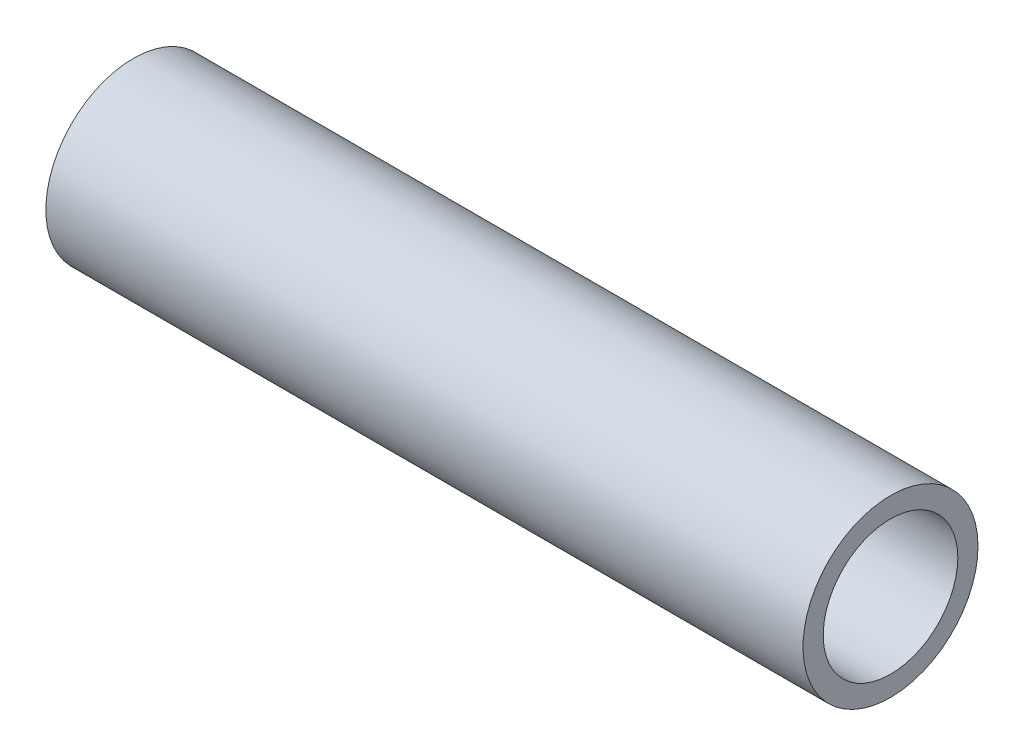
ISO-10303-21;
HEADER;
FILE_DESCRIPTION(('STEP AP214'),'2;1');
FILE_NAME('part.step','',(''),(''),'','','');
FILE_SCHEMA(('AUTOMOTIVE_DESIGN { 1 0 10303 214 1 1 1 1 }'));
ENDSEC;
DATA;
#1=APPLICATION_CONTEXT('core data for automotive mechanical design processes');
#2=APPLICATION_PROTOCOL_DEFINITION('international standard','automotive_design',2000,#1);
#3=PRODUCT_CONTEXT('',#1,'mechanical');
#4=PRODUCT('Part','Part','',(#3));
#5=PRODUCT_RELATED_PRODUCT_CATEGORY('part','',(#4));
#6=PRODUCT_DEFINITION_FORMATION('','',#4);
#7=PRODUCT_DEFINITION_CONTEXT('part definition',#1,'design');
#8=PRODUCT_DEFINITION('design','',#6,#7);
#9=PRODUCT_DEFINITION_SHAPE('','',#8);
#10=(LENGTH_UNIT() NAMED_UNIT(*) SI_UNIT(.MILLI.,.METRE.));
#11=(NAMED_UNIT(*) PLANE_ANGLE_UNIT() SI_UNIT($,.RADIAN.));
#12=(NAMED_UNIT(*) SI_UNIT($,.STERADIAN.) SOLID_ANGLE_UNIT());
#13=UNCERTAINTY_MEASURE_WITH_UNIT(LENGTH_MEASURE(1.E-05),#10,'distance_accuracy_value','');
#14=(GEOMETRIC_REPRESENTATION_CONTEXT(3) GLOBAL_UNCERTAINTY_ASSIGNED_CONTEXT((#13)) GLOBAL_UNIT_ASSIGNED_CONTEXT((#10,
#11,#12)) REPRESENTATION_CONTEXT('',''));
#15=CARTESIAN_POINT('',(0.,0.,0.));
#16=DIRECTION('',(0.,0.,1.));
#17=DIRECTION('',(1.,0.,0.));
#18=AXIS2_PLACEMENT_3D('',#15,#16,#17);
#19=CARTESIAN_POINT('',(142.875,2.22044604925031E-13,-8.88178419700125E-13));
#20=DIRECTION('',(-1.,0.,0.));
#21=DIRECTION('',(0.,0.,1.));
#22=AXIS2_PLACEMENT_3D('',#19,#20,#21);
#23=CYLINDRICAL_SURFACE('',#22,12.7);
#24=CARTESIAN_POINT('',(142.875,2.22044604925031E-13,-8.88178419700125E-13));
#25=DIRECTION('',(1.,0.,0.));
#26=DIRECTION('',(0.,0.,-1.));
#27=AXIS2_PLACEMENT_3D('',#24,#25,#26);
#28=CIRCLE('',#27,12.7);
#29=CARTESIAN_POINT('',(142.875,2.22044604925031E-13,-12.7000000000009));
#30=VERTEX_POINT('',#29);
#31=EDGE_CURVE('E40',#30,#30,#28,.T.);
#32=ORIENTED_EDGE('',*,*,#31,.T.);
#33=EDGE_LOOP('',(#32));
#34=FACE_BOUND('',#33,.T.);
#35=CARTESIAN_POINT('',(0.,0.,0.));
#36=DIRECTION('',(1.,0.,0.));
#37=DIRECTION('',(0.,0.,-1.));
#38=AXIS2_PLACEMENT_3D('',#35,#36,#37);
#39=CIRCLE('',#38,12.7);
#40=CARTESIAN_POINT('',(0.,0.,-12.7));
#41=VERTEX_POINT('',#40);
#42=EDGE_CURVE('E46',#41,#41,#39,.T.);
#43=ORIENTED_EDGE('',*,*,#42,.F.);
#44=EDGE_LOOP('',(#43));
#45=FACE_BOUND('',#44,.T.);
#46=ADVANCED_FACE('F33',(#34,#45),#23,.F.);
#47=CARTESIAN_POINT('',(142.875,2.22044604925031E-13,-8.88178419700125E-13));
#48=DIRECTION('',(-1.,0.,0.));
#49=DIRECTION('',(0.,0.,1.));
#50=AXIS2_PLACEMENT_3D('',#47,#48,#49);
#51=CYLINDRICAL_SURFACE('',#50,16.51);
#52=CARTESIAN_POINT('',(142.875,2.22044604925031E-13,-8.88178419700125E-13));
#53=DIRECTION('',(1.,0.,0.));
#54=DIRECTION('',(0.,0.,-1.));
#55=AXIS2_PLACEMENT_3D('',#52,#53,#54);
#56=CIRCLE('',#55,16.51);
#57=CARTESIAN_POINT('',(142.875,2.22044604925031E-13,-16.5100000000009));
#58=VERTEX_POINT('',#57);
#59=EDGE_CURVE('E10',#58,#58,#56,.T.);
#60=ORIENTED_EDGE('',*,*,#59,.F.);
#61=EDGE_LOOP('',(#60));
#62=FACE_BOUND('',#61,.T.);
#63=CARTESIAN_POINT('',(0.,0.,0.));
#64=DIRECTION('',(1.,0.,0.));
#65=DIRECTION('',(0.,0.,-1.));
#66=AXIS2_PLACEMENT_3D('',#63,#64,#65);
#67=CIRCLE('',#66,16.51);
#68=CARTESIAN_POINT('',(0.,0.,-16.51));
#69=VERTEX_POINT('',#68);
#70=EDGE_CURVE('E36',#69,#69,#67,.T.);
#71=ORIENTED_EDGE('',*,*,#70,.T.);
#72=EDGE_LOOP('',(#71));
#73=FACE_BOUND('',#72,.T.);
#74=ADVANCED_FACE('F53',(#62,#73),#51,.T.);
#75=CARTESIAN_POINT('',(142.875,2.22044604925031E-13,-8.88178419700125E-13));
#76=DIRECTION('',(1.,0.,0.));
#77=DIRECTION('',(0.,0.,-1.));
#78=AXIS2_PLACEMENT_3D('',#75,#76,#77);
#79=PLANE('',#78);
#80=ORIENTED_EDGE('',*,*,#31,.F.);
#81=EDGE_LOOP('',(#80));
#82=FACE_BOUND('',#81,.T.);
#83=ORIENTED_EDGE('',*,*,#59,.T.);
#84=EDGE_LOOP('',(#83));
#85=FACE_BOUND('',#84,.T.);
#86=ADVANCED_FACE('F57',(#82,#85),#79,.T.);
#87=CARTESIAN_POINT('',(0.,0.,0.));
#88=DIRECTION('',(1.,0.,0.));
#89=DIRECTION('',(0.,0.,-1.));
#90=AXIS2_PLACEMENT_3D('',#87,#88,#89);
#91=PLANE('',#90);
#92=ORIENTED_EDGE('',*,*,#42,.T.);
#93=EDGE_LOOP('',(#92));
#94=FACE_BOUND('',#93,.T.);
#95=ORIENTED_EDGE('',*,*,#70,.F.);
#96=EDGE_LOOP('',(#95));
#97=FACE_BOUND('',#96,.T.);
#98=ADVANCED_FACE('F55',(#94,#97),#91,.F.);
#99=CLOSED_SHELL('',(#46,#74,#86,#98));
#100=MANIFOLD_SOLID_BREP('B2',#99);
#101=ADVANCED_BREP_SHAPE_REPRESENTATION('',(#18,#100),#14);
#102=SHAPE_DEFINITION_REPRESENTATION(#9,#101);
ENDSEC;
END-ISO-10303-21;
